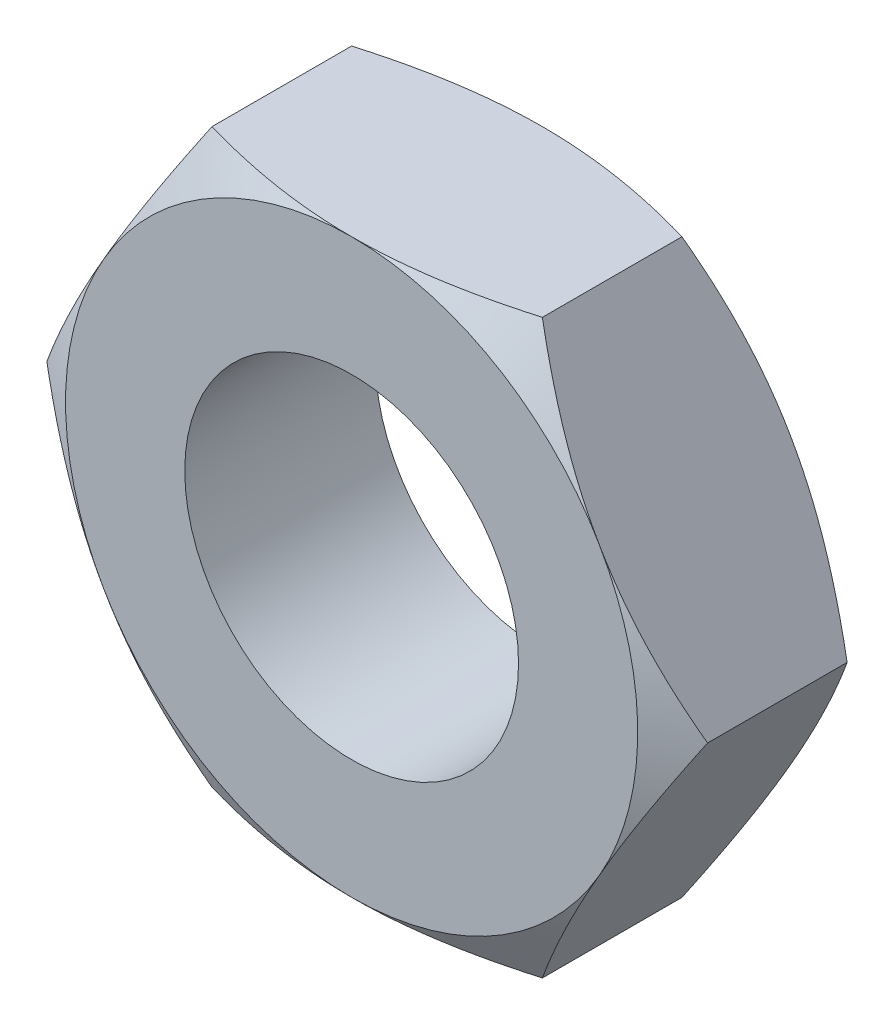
from build123d import *

# Parameters (mm, degrees)
EXTRUDE1_DEPTH = 10
TAPPED_HOLE1_D = 17.5


with BuildPart() as part:
    # Sketch1 → Extrude1 (new body)
    with BuildSketch(Plane.XY):
        Polygon((8.660254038, -15), (17.320508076, 0), (8.660254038, 15), (-8.660254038, 15), (-17.320508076, 0), (-8.660254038, -15), align=None)
    extrude(amount=EXTRUDE1_DEPTH)

    # Tapped Hole1 (through all)
    with Locations(Plane.XY.offset(10)):
        with Locations((0, 0)):
            Hole(TAPPED_HOLE1_D / 2)

    # Sketch4 → Cut-Revolve1 (revolve, cut)
    with BuildSketch(Plane(origin=(0, 0, 0), x_dir=(1, 0, 0), z_dir=(0, 1, 0)), mode=Mode.PRIVATE) as cut_revolve1_sk:
        Polygon((-17.320508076, -8.660254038), (-15, -10), (-17.320508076, -10), align=None)
        Polygon((-17.320508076, -1.339745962), (-15, 0), (-17.320508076, 0), align=None)
    revolve(cut_revolve1_sk.sketch.rotate(Axis((0, 0, 0), (0, 0, 1)), 180), axis=Axis((0, 0, 0), (0, 0, 1)), mode=Mode.SUBTRACT)


solid = part.part
